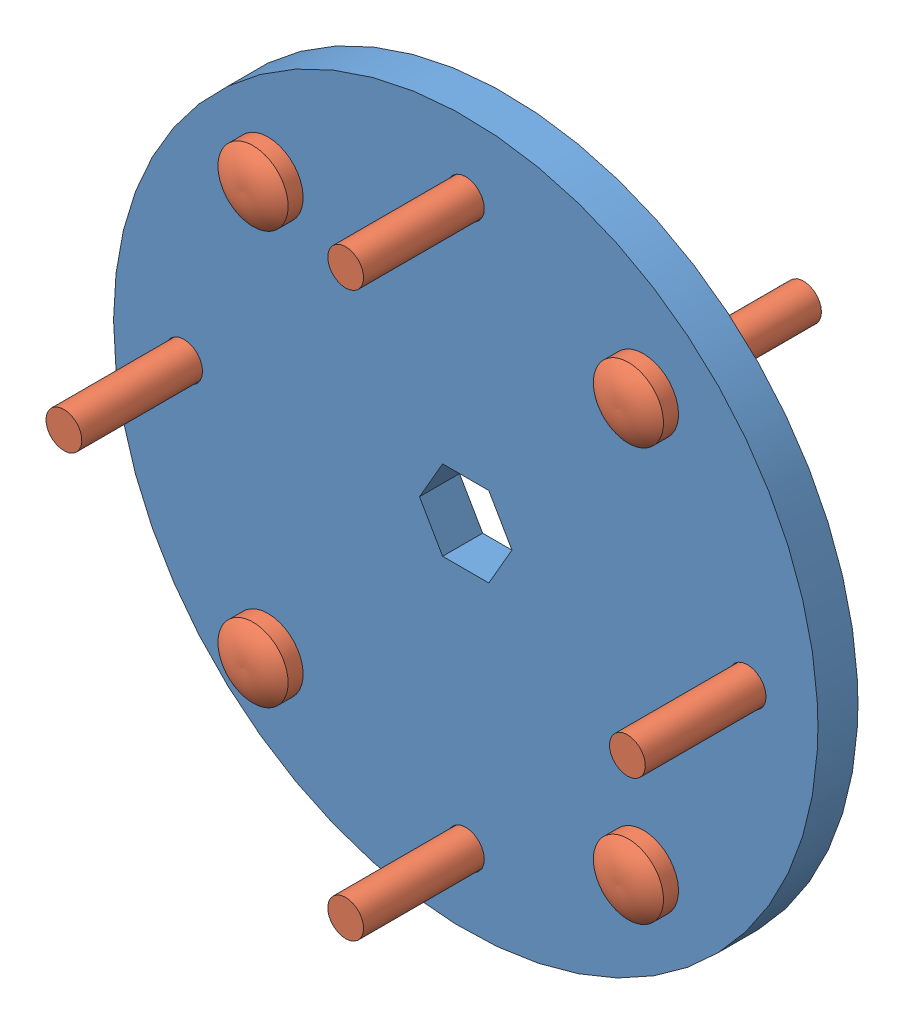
SolidWorks assembly CollarAssembly.SLDASM, configuration Default (file format 8000). Lengths in mm.
Overall size (55.88 55.88 22.22).
9 component instances, 2 part files, 16 mates.
Components (placement in the parent):
- Collar-1: Collar.SLDPRT [Default] at (24.697 30.4166 38.4268) size (55.88 55.88 3.17)
- Screw-No4-0p5-inch-1: Screw-No4-0p5-inch.SLDPRT [Default] at (9.0166 46.3457 28.9018) size (5.56 5.56 14.8)
- Screw-No4-0p5-inch-2: Screw-No4-0p5-inch.SLDPRT [Default] at (9.0166 13.6075 28.9018) size (5.56 5.56 14.8)
- Screw-No4-0p5-inch-3: Screw-No4-0p5-inch.SLDPRT [Default] at (38.7959 13.6075 28.9018) size (5.56 5.56 14.8)
- Screw-No4-0p5-inch-4: Screw-No4-0p5-inch.SLDPRT [Default] at (38.7959 46.3457 28.9018) size (5.56 5.56 14.8)
- Screw-No4-0p5-inch-7: Screw-No4-0p5-inch.SLDPRT [Default] at (24.697 52.7686 51.1268) x (-0.21644 -0.976296 0) z (0 0 -1) size (5.56 5.56 14.8)
- Screw-No4-0p5-inch-8: Screw-No4-0p5-inch.SLDPRT [Default] at (2.345 30.4166 51.1268) x (-0.923728 -0.383049 0) z (0 0 -1) size (5.56 5.56 14.8)
- Screw-No4-0p5-inch-9: Screw-No4-0p5-inch.SLDPRT [Default] at (47.049 30.4166 51.1268) x (-0.21644 -0.976296 0) z (0 0 -1) size (5.56 5.56 14.8)
- Screw-No4-0p5-inch-10: Screw-No4-0p5-inch.SLDPRT [Default] at (24.697 8.0646 51.1268) x (-0.21644 -0.976296 0) z (0 0 -1) size (5.56 5.56 14.8)
Mates (geometry in assembly coordinates):
- Concentric5: concentric aligned: circle of Collar-1; circle of Screw-No4-0p5-inch-1
- Concentric6: concentric aligned: circle of Collar-1; circle of Screw-No4-0p5-inch-2
- Concentric7: concentric aligned: circle of Collar-1; circle of Screw-No4-0p5-inch-3
- Concentric8: concentric aligned: circle of Collar-1; circle of Screw-No4-0p5-inch-4
- Coincident5: coincident anti-aligned: plane of Collar-1 through (24.697 30.4166 41.6018) normal (0 0 1); plane of Screw-No4-0p5-inch-2 through (9.0166 13.6075 41.6018) normal (0 0 -1)
- Coincident6: coincident anti-aligned: plane of Collar-1 through (24.697 30.4166 41.6018) normal (0 0 1); circle of Screw-No4-0p5-inch-3
- Coincident7: coincident anti-aligned: plane of Collar-1 through (24.697 30.4166 41.6018) normal (0 0 1); plane of Screw-No4-0p5-inch-1 through (9.0166 46.3457 41.6018) normal (0 0 -1)
- Coincident8: coincident anti-aligned: plane of Collar-1 through (24.697 30.4166 41.6018) normal (0 0 1); plane of Screw-No4-0p5-inch-4 through (38.7959 46.3457 41.6018) normal (0 0 -1)
- Concentric9: concentric anti-aligned: circle of Collar-1; circle of Screw-No4-0p5-inch-8
- Coincident9: coincident anti-aligned: plane of Collar-1 through (24.697 30.4166 38.4268) normal (0 0 -1); circle of Screw-No4-0p5-inch-8
- Concentric10: concentric anti-aligned: circle of Collar-1; circle of Screw-No4-0p5-inch-7
- Concentric11: concentric anti-aligned: circle of Collar-1; circle of Screw-No4-0p5-inch-9
- Concentric12: concentric anti-aligned: circle of Collar-1; circle of Screw-No4-0p5-inch-10
- Coincident10: coincident anti-aligned: plane of Collar-1 through (24.697 30.4166 38.4268) normal (0 0 -1); circle of Screw-No4-0p5-inch-10
- Coincident11: coincident anti-aligned: plane of Collar-1 through (24.697 30.4166 38.4268) normal (0 0 -1); plane of Screw-No4-0p5-inch-7 through (24.697 52.7686 38.4268) normal (0 0 1)
- Coincident12: coincident anti-aligned: plane of Collar-1 through (24.697 30.4166 38.4268) normal (0 0 -1); plane of Screw-No4-0p5-inch-9 through (47.049 30.4166 38.4268) normal (0 0 1)
